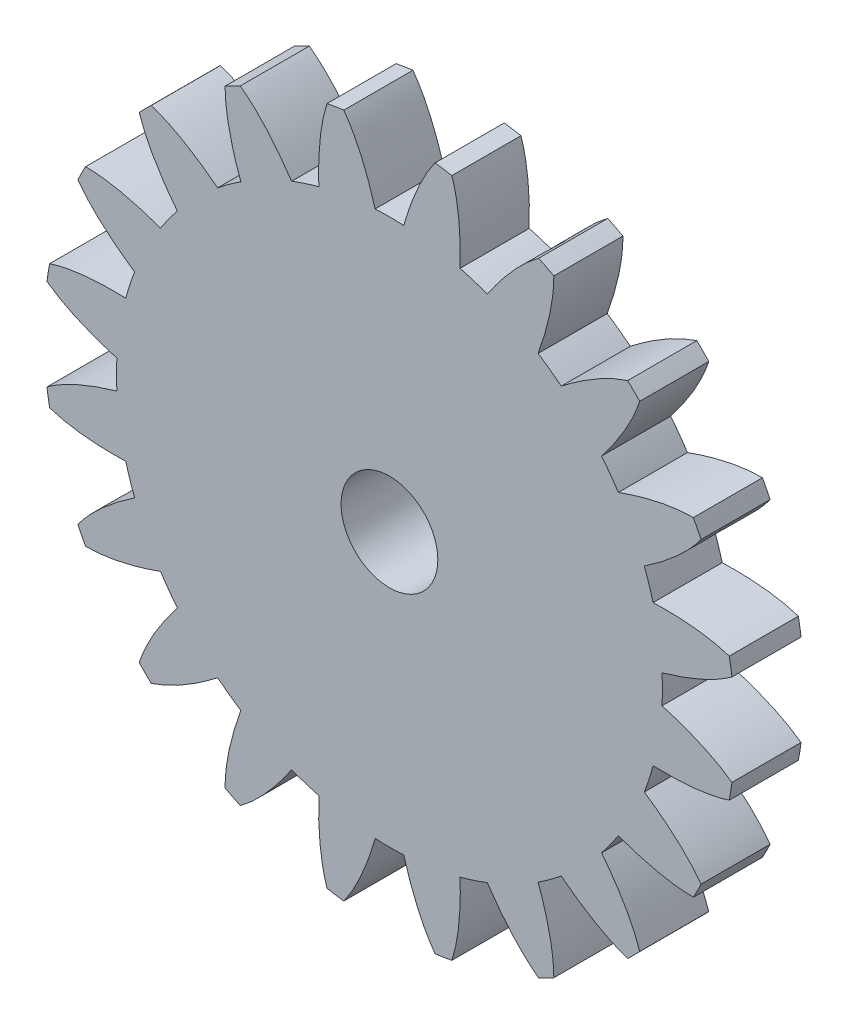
from build123d import *

# Parameters (mm, degrees)
SKETCH_3_R      = 7
EXTRUDE_1_DEPTH = 5


with BuildPart() as part:
    # Sketch 3 → Extrude 1 (new, symmetric)
    with BuildSketch(Plane.XY):
        with BuildLine():
            ThreePointArc((2.067270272, 39.445866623), (0, 39.5), (-2.067270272, 39.445866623))
            add(Edge.make_bspline(
                [(-2.067270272, 39.445866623), (-3.939430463, 45.907422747), (-6.604591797, 49.561874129)],
                knots=[0, 0, 0, 1, 1, 1], degree=2))
            ThreePointArc((-6.604591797, 49.561874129), (-7.821723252, 49.38441703), (-9.034121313, 49.177074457))
            add(Edge.make_bspline(
                [(-10.223352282, 38.154070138), (-10.439552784, 44.877904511), (-9.034121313, 49.177074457)],
                knots=[0, 0, 0, 1, 1, 1], degree=2))
            ThreePointArc((-10.223352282, 38.154070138), (-12.206171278, 37.566732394), (-14.155534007, 36.876426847))
            add(Edge.make_bspline(
                [(-14.155534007, 36.876426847), (-17.932794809, 42.443202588), (-21.596801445, 45.095212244)],
                knots=[0, 0, 0, 1, 1, 1], degree=2))
            ThreePointArc((-21.596801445, 45.095212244), (-22.699524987, 44.550326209), (-23.788511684, 43.978480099))
            add(Edge.make_bspline(
                [(-21.513241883, 33.127487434), (-23.796639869, 39.455424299), (-23.788511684, 43.978480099)],
                knots=[0, 0, 0, 1, 1, 1], degree=2))
            ThreePointArc((-21.513241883, 33.127487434), (-23.217517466, 31.956171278), (-24.858155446, 30.697265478))
            add(Edge.make_bspline(
                [(-24.858155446, 30.697265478), (-30.170772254, 34.824346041), (-34.474965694, 36.214316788)],
                knots=[0, 0, 0, 1, 1, 1], degree=2))
            ThreePointArc((-34.474965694, 36.214316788), (-35.355339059, 35.355339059), (-36.214316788, 34.474965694))
            add(Edge.make_bspline(
                [(-30.697265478, 24.858155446), (-34.824346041, 30.170772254), (-36.214316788, 34.474965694)],
                knots=[0, 0, 0, 1, 1, 1], degree=2))
            ThreePointArc((-30.697265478, 24.858155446), (-31.956171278, 23.217517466), (-33.127487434, 21.513241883))
            add(Edge.make_bspline(
                [(-33.127487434, 21.513241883), (-39.455424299, 23.796639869), (-43.978480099, 23.788511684)],
                knots=[0, 0, 0, 1, 1, 1], degree=2))
            ThreePointArc((-43.978480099, 23.788511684), (-44.550326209, 22.699524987), (-45.095212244, 21.596801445))
            add(Edge.make_bspline(
                [(-36.876426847, 14.155534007), (-42.443202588, 17.932794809), (-45.095212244, 21.596801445)],
                knots=[0, 0, 0, 1, 1, 1], degree=2))
            ThreePointArc((-36.876426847, 14.155534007), (-37.566732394, 12.206171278), (-38.154070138, 10.223352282))
            add(Edge.make_bspline(
                [(-38.154070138, 10.223352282), (-44.877904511, 10.439552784), (-49.177074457, 9.034121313)],
                knots=[0, 0, 0, 1, 1, 1], degree=2))
            ThreePointArc((-49.177074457, 9.034121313), (-49.38441703, 7.821723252), (-49.561874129, 6.604591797))
            add(Edge.make_bspline(
                [(-39.445866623, 2.067270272), (-45.907422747, 3.939430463), (-49.561874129, 6.604591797)],
                knots=[0, 0, 0, 1, 1, 1], degree=2))
            ThreePointArc((-39.445866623, 2.067270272), (-39.5, 0), (-39.445866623, -2.067270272))
            add(Edge.make_bspline(
                [(-39.445866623, -2.067270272), (-45.907422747, -3.939430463), (-49.561874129, -6.604591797)],
                knots=[0, 0, 0, 1, 1, 1], degree=2))
            ThreePointArc((-49.561874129, -6.604591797), (-49.38441703, -7.821723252), (-49.177074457, -9.034121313))
            add(Edge.make_bspline(
                [(-38.154070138, -10.223352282), (-44.877904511, -10.439552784), (-49.177074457, -9.034121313)],
                knots=[0, 0, 0, 1, 1, 1], degree=2))
            ThreePointArc((-38.154070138, -10.223352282), (-37.566732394, -12.206171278), (-36.876426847, -14.155534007))
            add(Edge.make_bspline(
                [(-36.876426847, -14.155534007), (-42.443202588, -17.932794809), (-45.095212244, -21.596801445)],
                knots=[0, 0, 0, 1, 1, 1], degree=2))
            ThreePointArc((-45.095212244, -21.596801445), (-44.550326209, -22.699524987), (-43.978480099, -23.788511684))
            add(Edge.make_bspline(
                [(-33.127487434, -21.513241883), (-39.455424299, -23.796639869), (-43.978480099, -23.788511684)],
                knots=[0, 0, 0, 1, 1, 1], degree=2))
            ThreePointArc((-33.127487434, -21.513241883), (-31.956171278, -23.217517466), (-30.697265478, -24.858155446))
            add(Edge.make_bspline(
                [(-30.697265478, -24.858155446), (-34.824346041, -30.170772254), (-36.214316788, -34.474965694)],
                knots=[0, 0, 0, 1, 1, 1], degree=2))
            ThreePointArc((-36.214316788, -34.474965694), (-35.355339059, -35.355339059), (-34.474965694, -36.214316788))
            add(Edge.make_bspline(
                [(-24.858155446, -30.697265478), (-30.170772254, -34.824346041), (-34.474965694, -36.214316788)],
                knots=[0, 0, 0, 1, 1, 1], degree=2))
            ThreePointArc((-24.858155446, -30.697265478), (-23.217517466, -31.956171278), (-21.513241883, -33.127487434))
            add(Edge.make_bspline(
                [(-21.513241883, -33.127487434), (-23.796639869, -39.455424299), (-23.788511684, -43.978480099)],
                knots=[0, 0, 0, 1, 1, 1], degree=2))
            ThreePointArc((-23.788511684, -43.978480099), (-22.699524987, -44.550326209), (-21.596801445, -45.095212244))
            add(Edge.make_bspline(
                [(-14.155534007, -36.876426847), (-17.932794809, -42.443202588), (-21.596801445, -45.095212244)],
                knots=[0, 0, 0, 1, 1, 1], degree=2))
            ThreePointArc((-14.155534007, -36.876426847), (-12.206171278, -37.566732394), (-10.223352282, -38.154070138))
            add(Edge.make_bspline(
                [(-10.223352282, -38.154070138), (-10.439552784, -44.877904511), (-9.034121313, -49.177074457)],
                knots=[0, 0, 0, 1, 1, 1], degree=2))
            ThreePointArc((-9.034121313, -49.177074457), (-7.821723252, -49.38441703), (-6.604591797, -49.561874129))
            add(Edge.make_bspline(
                [(-2.067270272, -39.445866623), (-3.939430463, -45.907422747), (-6.604591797, -49.561874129)],
                knots=[0, 0, 0, 1, 1, 1], degree=2))
            ThreePointArc((-2.067270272, -39.445866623), (0, -39.5), (2.067270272, -39.445866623))
            add(Edge.make_bspline(
                [(2.067270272, -39.445866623), (3.939430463, -45.907422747), (6.604591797, -49.561874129)],
                knots=[0, 0, 0, 1, 1, 1], degree=2))
            ThreePointArc((6.604591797, -49.561874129), (7.821723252, -49.38441703), (9.034121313, -49.177074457))
            add(Edge.make_bspline(
                [(10.223352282, -38.154070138), (10.439552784, -44.877904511), (9.034121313, -49.177074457)],
                knots=[0, 0, 0, 1, 1, 1], degree=2))
            ThreePointArc((10.223352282, -38.154070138), (12.206171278, -37.566732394), (14.155534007, -36.876426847))
            add(Edge.make_bspline(
                [(14.155534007, -36.876426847), (17.932794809, -42.443202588), (21.596801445, -45.095212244)],
                knots=[0, 0, 0, 1, 1, 1], degree=2))
            ThreePointArc((21.596801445, -45.095212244), (22.699524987, -44.550326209), (23.788511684, -43.978480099))
            add(Edge.make_bspline(
                [(21.513241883, -33.127487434), (23.796639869, -39.455424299), (23.788511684, -43.978480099)],
                knots=[0, 0, 0, 1, 1, 1], degree=2))
            ThreePointArc((21.513241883, -33.127487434), (23.217517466, -31.956171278), (24.858155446, -30.697265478))
            add(Edge.make_bspline(
                [(24.858155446, -30.697265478), (30.170772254, -34.824346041), (34.474965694, -36.214316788)],
                knots=[0, 0, 0, 1, 1, 1], degree=2))
            ThreePointArc((34.474965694, -36.214316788), (35.355339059, -35.355339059), (36.214316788, -34.474965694))
            add(Edge.make_bspline(
                [(30.697265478, -24.858155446), (34.824346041, -30.170772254), (36.214316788, -34.474965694)],
                knots=[0, 0, 0, 1, 1, 1], degree=2))
            ThreePointArc((30.697265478, -24.858155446), (31.956171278, -23.217517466), (33.127487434, -21.513241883))
            add(Edge.make_bspline(
                [(33.127487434, -21.513241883), (39.455424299, -23.796639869), (43.978480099, -23.788511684)],
                knots=[0, 0, 0, 1, 1, 1], degree=2))
            ThreePointArc((43.978480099, -23.788511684), (44.550326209, -22.699524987), (45.095212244, -21.596801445))
            add(Edge.make_bspline(
                [(36.876426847, -14.155534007), (42.443202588, -17.932794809), (45.095212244, -21.596801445)],
                knots=[0, 0, 0, 1, 1, 1], degree=2))
            ThreePointArc((36.876426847, -14.155534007), (37.566732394, -12.206171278), (38.154070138, -10.223352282))
            add(Edge.make_bspline(
                [(38.154070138, -10.223352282), (44.877904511, -10.439552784), (49.177074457, -9.034121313)],
                knots=[0, 0, 0, 1, 1, 1], degree=2))
            ThreePointArc((49.177074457, -9.034121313), (49.38441703, -7.821723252), (49.561874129, -6.604591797))
            add(Edge.make_bspline(
                [(39.445866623, -2.067270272), (45.907422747, -3.939430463), (49.561874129, -6.604591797)],
                knots=[0, 0, 0, 1, 1, 1], degree=2))
            ThreePointArc((39.445866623, -2.067270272), (39.5, 0), (39.445866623, 2.067270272))
            add(Edge.make_bspline(
                [(39.445866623, 2.067270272), (45.907422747, 3.939430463), (49.561874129, 6.604591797)],
                knots=[0, 0, 0, 1, 1, 1], degree=2))
            ThreePointArc((49.561874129, 6.604591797), (49.38441703, 7.821723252), (49.177074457, 9.034121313))
            add(Edge.make_bspline(
                [(38.154070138, 10.223352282), (44.877904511, 10.439552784), (49.177074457, 9.034121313)],
                knots=[0, 0, 0, 1, 1, 1], degree=2))
            ThreePointArc((38.154070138, 10.223352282), (37.566732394, 12.206171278), (36.876426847, 14.155534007))
            add(Edge.make_bspline(
                [(36.876426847, 14.155534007), (42.443202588, 17.932794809), (45.095212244, 21.596801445)],
                knots=[0, 0, 0, 1, 1, 1], degree=2))
            ThreePointArc((45.095212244, 21.596801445), (44.550326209, 22.699524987), (43.978480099, 23.788511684))
            add(Edge.make_bspline(
                [(33.127487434, 21.513241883), (39.455424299, 23.796639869), (43.978480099, 23.788511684)],
                knots=[0, 0, 0, 1, 1, 1], degree=2))
            ThreePointArc((33.127487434, 21.513241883), (31.956171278, 23.217517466), (30.697265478, 24.858155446))
            add(Edge.make_bspline(
                [(30.697265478, 24.858155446), (34.824346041, 30.170772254), (36.214316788, 34.474965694)],
                knots=[0, 0, 0, 1, 1, 1], degree=2))
            ThreePointArc((36.214316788, 34.474965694), (35.355339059, 35.355339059), (34.474965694, 36.214316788))
            add(Edge.make_bspline(
                [(24.858155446, 30.697265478), (30.170772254, 34.824346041), (34.474965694, 36.214316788)],
                knots=[0, 0, 0, 1, 1, 1], degree=2))
            ThreePointArc((24.858155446, 30.697265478), (23.217517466, 31.956171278), (21.513241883, 33.127487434))
            add(Edge.make_bspline(
                [(21.513241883, 33.127487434), (23.796639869, 39.455424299), (23.788511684, 43.978480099)],
                knots=[0, 0, 0, 1, 1, 1], degree=2))
            ThreePointArc((23.788511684, 43.978480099), (22.699524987, 44.550326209), (21.596801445, 45.095212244))
            add(Edge.make_bspline(
                [(14.155534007, 36.876426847), (17.932794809, 42.443202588), (21.596801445, 45.095212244)],
                knots=[0, 0, 0, 1, 1, 1], degree=2))
            ThreePointArc((14.155534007, 36.876426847), (12.206171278, 37.566732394), (10.223352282, 38.154070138))
            add(Edge.make_bspline(
                [(10.223352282, 38.154070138), (10.439552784, 44.877904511), (9.034121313, 49.177074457)],
                knots=[0, 0, 0, 1, 1, 1], degree=2))
            ThreePointArc((9.034121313, 49.177074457), (7.821723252, 49.38441703), (6.604591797, 49.561874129))
            add(Edge.make_bspline(
                [(2.067270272, 39.445866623), (3.939430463, 45.907422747), (6.604591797, 49.561874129)],
                knots=[0, 0, 0, 1, 1, 1], degree=2))
        make_face()
        Circle(SKETCH_3_R, mode=Mode.SUBTRACT)
    extrude(amount=EXTRUDE_1_DEPTH, both=True)


solid = part.part
